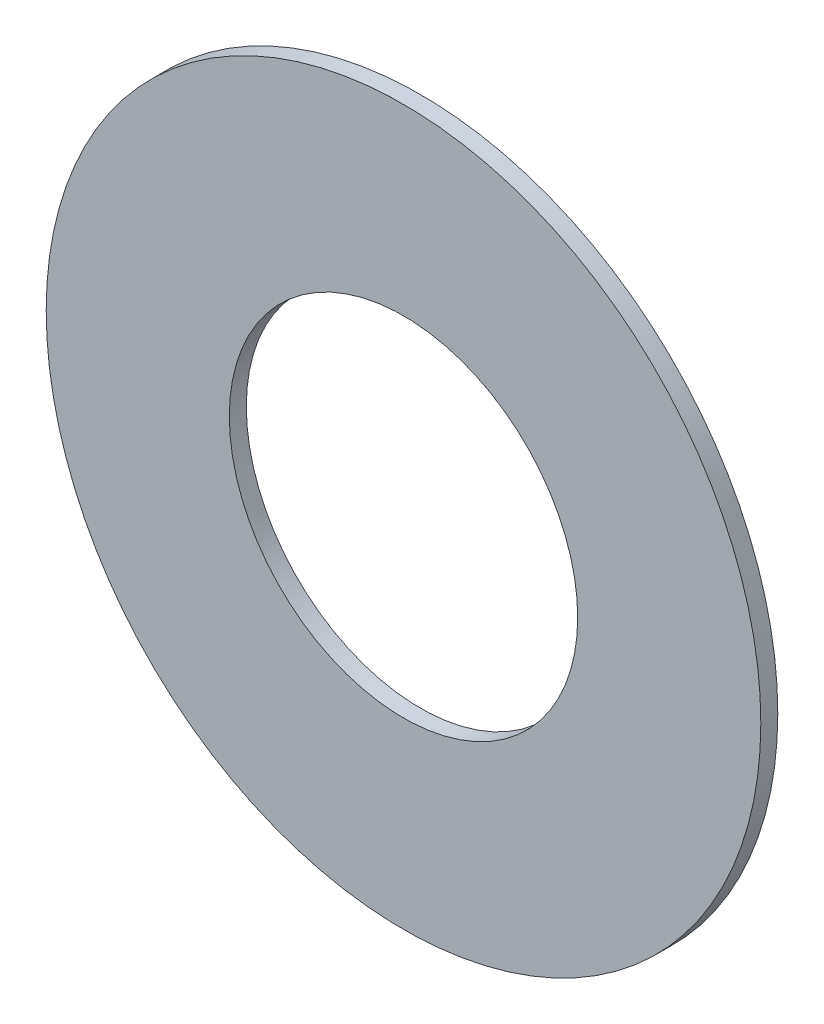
from build123d import *

# Parameters (mm, degrees)
SKETCH1_R           = 50.8
BOSS_EXTRUDE1_DEPTH = 2.413
SKETCH2_R           = 24.765
CUT_EXTRUDE1_DEPTH  = 2.413


with BuildPart() as part:
    # Sketch1 → Boss-Extrude1 (new body)
    with BuildSketch(Plane.XY):
        Circle(SKETCH1_R)
    extrude(amount=BOSS_EXTRUDE1_DEPTH)

    # Sketch2 → Cut-Extrude1 (cut)
    with BuildSketch(Plane.XY.offset(2.413)):
        Circle(SKETCH2_R)
    extrude(amount=-CUT_EXTRUDE1_DEPTH, mode=Mode.SUBTRACT)


solid = part.part
